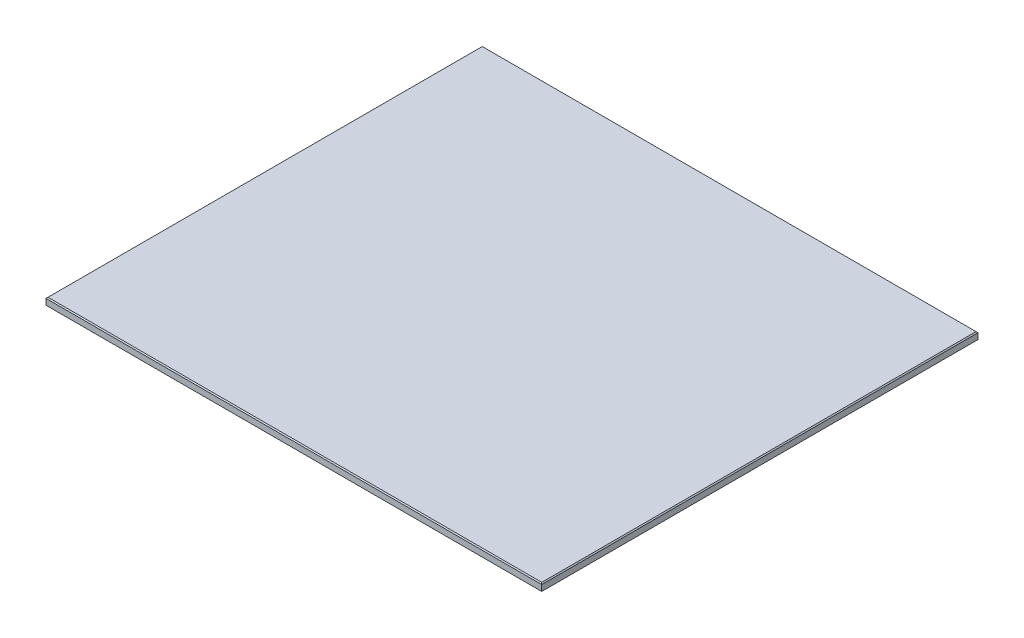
ISO-10303-21;
HEADER;
FILE_DESCRIPTION(('STEP AP214'),'2;1');
FILE_NAME('part.step','',(''),(''),'','','');
FILE_SCHEMA(('AUTOMOTIVE_DESIGN { 1 0 10303 214 1 1 1 1 }'));
ENDSEC;
DATA;
#1=APPLICATION_CONTEXT('core data for automotive mechanical design processes');
#2=APPLICATION_PROTOCOL_DEFINITION('international standard','automotive_design',2000,#1);
#3=PRODUCT_CONTEXT('',#1,'mechanical');
#4=PRODUCT('Part','Part','',(#3));
#5=PRODUCT_RELATED_PRODUCT_CATEGORY('part','',(#4));
#6=PRODUCT_DEFINITION_FORMATION('','',#4);
#7=PRODUCT_DEFINITION_CONTEXT('part definition',#1,'design');
#8=PRODUCT_DEFINITION('design','',#6,#7);
#9=PRODUCT_DEFINITION_SHAPE('','',#8);
#10=(LENGTH_UNIT() NAMED_UNIT(*) SI_UNIT(.MILLI.,.METRE.));
#11=(NAMED_UNIT(*) PLANE_ANGLE_UNIT() SI_UNIT($,.RADIAN.));
#12=(NAMED_UNIT(*) SI_UNIT($,.STERADIAN.) SOLID_ANGLE_UNIT());
#13=UNCERTAINTY_MEASURE_WITH_UNIT(LENGTH_MEASURE(1.E-05),#10,'distance_accuracy_value','');
#14=(GEOMETRIC_REPRESENTATION_CONTEXT(3) GLOBAL_UNCERTAINTY_ASSIGNED_CONTEXT((#13)) GLOBAL_UNIT_ASSIGNED_CONTEXT((#10,
#11,#12)) REPRESENTATION_CONTEXT('',''));
#15=CARTESIAN_POINT('',(0.,0.,0.));
#16=DIRECTION('',(0.,0.,1.));
#17=DIRECTION('',(1.,0.,0.));
#18=AXIS2_PLACEMENT_3D('',#15,#16,#17);
#19=CARTESIAN_POINT('',(125.,4.,110.));
#20=DIRECTION('',(-1.,0.,0.));
#21=DIRECTION('',(0.,0.,1.));
#22=AXIS2_PLACEMENT_3D('',#19,#20,#21);
#23=PLANE('',#22);
#24=DIRECTION('',(0.,-1.,0.));
#25=VECTOR('',#24,1.);
#26=CARTESIAN_POINT('',(125.,4.,110.));
#27=LINE('',#26,#25);
#28=CARTESIAN_POINT('',(125.,3.5,110.));
#29=VERTEX_POINT('',#28);
#30=CARTESIAN_POINT('',(125.,0.5,110.));
#31=VERTEX_POINT('',#30);
#32=EDGE_CURVE('E142',#29,#31,#27,.T.);
#33=ORIENTED_EDGE('',*,*,#32,.T.);
#34=DIRECTION('',(0.,0.,-1.));
#35=VECTOR('',#34,1.);
#36=CARTESIAN_POINT('',(125.,0.5,-110.));
#37=LINE('',#36,#35);
#38=CARTESIAN_POINT('',(125.,0.5,-110.));
#39=VERTEX_POINT('',#38);
#40=EDGE_CURVE('E151',#31,#39,#37,.T.);
#41=ORIENTED_EDGE('',*,*,#40,.T.);
#42=DIRECTION('',(0.,-1.,0.));
#43=VECTOR('',#42,1.);
#44=CARTESIAN_POINT('',(125.,4.,-110.));
#45=LINE('',#44,#43);
#46=CARTESIAN_POINT('',(125.,3.5,-110.));
#47=VERTEX_POINT('',#46);
#48=EDGE_CURVE('E120',#47,#39,#45,.T.);
#49=ORIENTED_EDGE('',*,*,#48,.F.);
#50=DIRECTION('',(0.,0.,1.));
#51=VECTOR('',#50,1.);
#52=CARTESIAN_POINT('',(125.,3.5,110.));
#53=LINE('',#52,#51);
#54=EDGE_CURVE('E153',#47,#29,#53,.T.);
#55=ORIENTED_EDGE('',*,*,#54,.T.);
#56=EDGE_LOOP('',(#33,#41,#49,#55));
#57=FACE_BOUND('',#56,.T.);
#58=ADVANCED_FACE('F33',(#57),#23,.F.);
#59=CARTESIAN_POINT('',(-125.,4.,-110.));
#60=DIRECTION('',(0.,0.,1.));
#61=DIRECTION('',(1.,0.,0.));
#62=AXIS2_PLACEMENT_3D('',#59,#60,#61);
#63=PLANE('',#62);
#64=ORIENTED_EDGE('',*,*,#48,.T.);
#65=DIRECTION('',(-1.,0.,0.));
#66=VECTOR('',#65,1.);
#67=CARTESIAN_POINT('',(-125.,0.5,-110.));
#68=LINE('',#67,#66);
#69=CARTESIAN_POINT('',(-125.,0.5,-110.));
#70=VERTEX_POINT('',#69);
#71=EDGE_CURVE('E119',#39,#70,#68,.T.);
#72=ORIENTED_EDGE('',*,*,#71,.T.);
#73=DIRECTION('',(0.,-1.,0.));
#74=VECTOR('',#73,1.);
#75=CARTESIAN_POINT('',(-125.,4.,-110.));
#76=LINE('',#75,#74);
#77=CARTESIAN_POINT('',(-125.,3.5,-110.));
#78=VERTEX_POINT('',#77);
#79=EDGE_CURVE('E102',#78,#70,#76,.T.);
#80=ORIENTED_EDGE('',*,*,#79,.F.);
#81=DIRECTION('',(1.,0.,0.));
#82=VECTOR('',#81,1.);
#83=CARTESIAN_POINT('',(-125.,3.5,-110.));
#84=LINE('',#83,#82);
#85=EDGE_CURVE('E116',#78,#47,#84,.T.);
#86=ORIENTED_EDGE('',*,*,#85,.T.);
#87=EDGE_LOOP('',(#64,#72,#80,#86));
#88=FACE_BOUND('',#87,.T.);
#89=ADVANCED_FACE('F115',(#88),#63,.F.);
#90=CARTESIAN_POINT('',(-125.,4.,110.));
#91=DIRECTION('',(1.,0.,0.));
#92=DIRECTION('',(0.,0.,-1.));
#93=AXIS2_PLACEMENT_3D('',#90,#91,#92);
#94=PLANE('',#93);
#95=ORIENTED_EDGE('',*,*,#79,.T.);
#96=DIRECTION('',(0.,0.,1.));
#97=VECTOR('',#96,1.);
#98=CARTESIAN_POINT('',(-125.,0.5,110.));
#99=LINE('',#98,#97);
#100=CARTESIAN_POINT('',(-125.,0.5,110.));
#101=VERTEX_POINT('',#100);
#102=EDGE_CURVE('E108',#70,#101,#99,.T.);
#103=ORIENTED_EDGE('',*,*,#102,.T.);
#104=DIRECTION('',(0.,-1.,0.));
#105=VECTOR('',#104,1.);
#106=CARTESIAN_POINT('',(-125.,4.,110.));
#107=LINE('',#106,#105);
#108=CARTESIAN_POINT('',(-125.,3.5,110.));
#109=VERTEX_POINT('',#108);
#110=EDGE_CURVE('E104',#109,#101,#107,.T.);
#111=ORIENTED_EDGE('',*,*,#110,.F.);
#112=DIRECTION('',(0.,0.,-1.));
#113=VECTOR('',#112,1.);
#114=CARTESIAN_POINT('',(-125.,3.5,110.));
#115=LINE('',#114,#113);
#116=EDGE_CURVE('E99',#109,#78,#115,.T.);
#117=ORIENTED_EDGE('',*,*,#116,.T.);
#118=EDGE_LOOP('',(#95,#103,#111,#117));
#119=FACE_BOUND('',#118,.T.);
#120=ADVANCED_FACE('F101',(#119),#94,.F.);
#121=CARTESIAN_POINT('',(-125.,4.,110.));
#122=DIRECTION('',(0.,0.,-1.));
#123=DIRECTION('',(-1.,0.,0.));
#124=AXIS2_PLACEMENT_3D('',#121,#122,#123);
#125=PLANE('',#124);
#126=ORIENTED_EDGE('',*,*,#110,.T.);
#127=DIRECTION('',(1.,0.,0.));
#128=VECTOR('',#127,1.);
#129=CARTESIAN_POINT('',(125.,0.5,110.));
#130=LINE('',#129,#128);
#131=EDGE_CURVE('E155',#101,#31,#130,.T.);
#132=ORIENTED_EDGE('',*,*,#131,.T.);
#133=ORIENTED_EDGE('',*,*,#32,.F.);
#134=DIRECTION('',(-1.,0.,0.));
#135=VECTOR('',#134,1.);
#136=CARTESIAN_POINT('',(-125.,3.5,110.));
#137=LINE('',#136,#135);
#138=EDGE_CURVE('E157',#29,#109,#137,.T.);
#139=ORIENTED_EDGE('',*,*,#138,.T.);
#140=EDGE_LOOP('',(#126,#132,#133,#139));
#141=FACE_BOUND('',#140,.T.);
#142=ADVANCED_FACE('F195',(#141),#125,.F.);
#143=CARTESIAN_POINT('',(0.,4.,0.));
#144=DIRECTION('',(0.,-1.,0.));
#145=DIRECTION('',(0.,0.,-1.));
#146=AXIS2_PLACEMENT_3D('',#143,#144,#145);
#147=PLANE('',#146);
#148=DIRECTION('',(0.,0.,1.));
#149=VECTOR('',#148,1.);
#150=CARTESIAN_POINT('',(-124.5,4.,0.));
#151=LINE('',#150,#149);
#152=CARTESIAN_POINT('',(-124.5,4.,-109.5));
#153=VERTEX_POINT('',#152);
#154=CARTESIAN_POINT('',(-124.5,4.,109.5));
#155=VERTEX_POINT('',#154);
#156=EDGE_CURVE('E42',#153,#155,#151,.T.);
#157=ORIENTED_EDGE('',*,*,#156,.T.);
#158=DIRECTION('',(1.,0.,0.));
#159=VECTOR('',#158,1.);
#160=CARTESIAN_POINT('',(0.,4.,109.5));
#161=LINE('',#160,#159);
#162=CARTESIAN_POINT('',(124.5,4.,109.5));
#163=VERTEX_POINT('',#162);
#164=EDGE_CURVE('E11',#155,#163,#161,.T.);
#165=ORIENTED_EDGE('',*,*,#164,.T.);
#166=DIRECTION('',(0.,0.,-1.));
#167=VECTOR('',#166,1.);
#168=CARTESIAN_POINT('',(124.5,4.,0.));
#169=LINE('',#168,#167);
#170=CARTESIAN_POINT('',(124.5,4.,-109.5));
#171=VERTEX_POINT('',#170);
#172=EDGE_CURVE('E149',#163,#171,#169,.T.);
#173=ORIENTED_EDGE('',*,*,#172,.T.);
#174=DIRECTION('',(-1.,0.,0.));
#175=VECTOR('',#174,1.);
#176=CARTESIAN_POINT('',(0.,4.,-109.5));
#177=LINE('',#176,#175);
#178=EDGE_CURVE('E53',#171,#153,#177,.T.);
#179=ORIENTED_EDGE('',*,*,#178,.T.);
#180=EDGE_LOOP('',(#157,#165,#173,#179));
#181=FACE_BOUND('',#180,.T.);
#182=ADVANCED_FACE('F201',(#181),#147,.F.);
#183=CARTESIAN_POINT('',(0.,0.,0.));
#184=DIRECTION('',(0.,-1.,0.));
#185=DIRECTION('',(0.,0.,-1.));
#186=AXIS2_PLACEMENT_3D('',#183,#184,#185);
#187=PLANE('',#186);
#188=DIRECTION('',(0.,0.,-1.));
#189=VECTOR('',#188,1.);
#190=CARTESIAN_POINT('',(-124.5,0.,-110.));
#191=LINE('',#190,#189);
#192=CARTESIAN_POINT('',(-124.5,0.,109.5));
#193=VERTEX_POINT('',#192);
#194=CARTESIAN_POINT('',(-124.5,0.,-109.5));
#195=VERTEX_POINT('',#194);
#196=EDGE_CURVE('E162',#193,#195,#191,.T.);
#197=ORIENTED_EDGE('',*,*,#196,.T.);
#198=DIRECTION('',(1.,0.,0.));
#199=VECTOR('',#198,1.);
#200=CARTESIAN_POINT('',(125.,0.,-109.5));
#201=LINE('',#200,#199);
#202=CARTESIAN_POINT('',(124.5,0.,-109.5));
#203=VERTEX_POINT('',#202);
#204=EDGE_CURVE('E109',#195,#203,#201,.T.);
#205=ORIENTED_EDGE('',*,*,#204,.T.);
#206=DIRECTION('',(0.,0.,1.));
#207=VECTOR('',#206,1.);
#208=CARTESIAN_POINT('',(124.5,0.,110.));
#209=LINE('',#208,#207);
#210=CARTESIAN_POINT('',(124.5,0.,109.5));
#211=VERTEX_POINT('',#210);
#212=EDGE_CURVE('E166',#203,#211,#209,.T.);
#213=ORIENTED_EDGE('',*,*,#212,.T.);
#214=DIRECTION('',(-1.,0.,0.));
#215=VECTOR('',#214,1.);
#216=CARTESIAN_POINT('',(-125.,0.,109.5));
#217=LINE('',#216,#215);
#218=EDGE_CURVE('E164',#211,#193,#217,.T.);
#219=ORIENTED_EDGE('',*,*,#218,.T.);
#220=EDGE_LOOP('',(#197,#205,#213,#219));
#221=FACE_BOUND('',#220,.T.);
#222=ADVANCED_FACE('F203',(#221),#187,.T.);
#223=CARTESIAN_POINT('',(-125.,0.5,110.));
#224=DIRECTION('',(0.,-0.707106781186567,0.707106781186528));
#225=DIRECTION('',(-1.,0.,0.));
#226=AXIS2_PLACEMENT_3D('',#223,#224,#225);
#227=PLANE('',#226);
#228=DIRECTION('',(0.577350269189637,-0.577350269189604,-0.577350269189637));
#229=VECTOR('',#228,1.);
#230=CARTESIAN_POINT('',(-125.,0.5,110.));
#231=LINE('',#230,#229);
#232=EDGE_CURVE('E143',#193,#101,#231,.F.);
#233=ORIENTED_EDGE('',*,*,#232,.F.);
#234=ORIENTED_EDGE('',*,*,#218,.F.);
#235=DIRECTION('',(-0.577350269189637,-0.577350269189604,-0.577350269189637));
#236=VECTOR('',#235,1.);
#237=CARTESIAN_POINT('',(125.,0.5,110.));
#238=LINE('',#237,#236);
#239=EDGE_CURVE('E139',#31,#211,#238,.T.);
#240=ORIENTED_EDGE('',*,*,#239,.F.);
#241=ORIENTED_EDGE('',*,*,#131,.F.);
#242=EDGE_LOOP('',(#233,#234,#240,#241));
#243=FACE_BOUND('',#242,.T.);
#244=ADVANCED_FACE('F182',(#243),#227,.T.);
#245=CARTESIAN_POINT('',(125.,0.5,110.));
#246=DIRECTION('',(0.707106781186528,-0.707106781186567,0.));
#247=DIRECTION('',(0.,0.,1.));
#248=AXIS2_PLACEMENT_3D('',#245,#246,#247);
#249=PLANE('',#248);
#250=ORIENTED_EDGE('',*,*,#239,.T.);
#251=ORIENTED_EDGE('',*,*,#212,.F.);
#252=DIRECTION('',(0.577350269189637,0.577350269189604,-0.577350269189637));
#253=VECTOR('',#252,1.);
#254=CARTESIAN_POINT('',(51.6666666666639,-72.833333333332,-36.666666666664));
#255=LINE('',#254,#253);
#256=EDGE_CURVE('E130',#39,#203,#255,.F.);
#257=ORIENTED_EDGE('',*,*,#256,.F.);
#258=ORIENTED_EDGE('',*,*,#40,.F.);
#259=EDGE_LOOP('',(#250,#251,#257,#258));
#260=FACE_BOUND('',#259,.T.);
#261=ADVANCED_FACE('F186',(#260),#249,.T.);
#262=CARTESIAN_POINT('',(-125.,0.5,110.));
#263=DIRECTION('',(-0.707106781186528,-0.707106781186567,0.));
#264=DIRECTION('',(0.,0.,-1.));
#265=AXIS2_PLACEMENT_3D('',#262,#263,#264);
#266=PLANE('',#265);
#267=ORIENTED_EDGE('',*,*,#232,.T.);
#268=ORIENTED_EDGE('',*,*,#102,.F.);
#269=DIRECTION('',(0.577350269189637,-0.577350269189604,0.577350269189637));
#270=VECTOR('',#269,1.);
#271=CARTESIAN_POINT('',(-51.6666666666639,-72.833333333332,-36.666666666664));
#272=LINE('',#271,#270);
#273=EDGE_CURVE('E129',#195,#70,#272,.F.);
#274=ORIENTED_EDGE('',*,*,#273,.F.);
#275=ORIENTED_EDGE('',*,*,#196,.F.);
#276=EDGE_LOOP('',(#267,#268,#274,#275));
#277=FACE_BOUND('',#276,.T.);
#278=ADVANCED_FACE('F194',(#277),#266,.T.);
#279=CARTESIAN_POINT('',(-125.,0.5,-110.));
#280=DIRECTION('',(0.,-0.707106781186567,-0.707106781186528));
#281=DIRECTION('',(1.,0.,0.));
#282=AXIS2_PLACEMENT_3D('',#279,#280,#281);
#283=PLANE('',#282);
#284=ORIENTED_EDGE('',*,*,#256,.T.);
#285=ORIENTED_EDGE('',*,*,#204,.F.);
#286=ORIENTED_EDGE('',*,*,#273,.T.);
#287=ORIENTED_EDGE('',*,*,#71,.F.);
#288=EDGE_LOOP('',(#284,#285,#286,#287));
#289=FACE_BOUND('',#288,.T.);
#290=ADVANCED_FACE('F189',(#289),#283,.T.);
#291=CARTESIAN_POINT('',(0.,4.,-109.5));
#292=DIRECTION('',(0.,-0.707106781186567,0.707106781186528));
#293=DIRECTION('',(-1.,0.,0.));
#294=AXIS2_PLACEMENT_3D('',#291,#292,#293);
#295=PLANE('',#294);
#296=DIRECTION('',(-0.577350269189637,0.577350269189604,0.577350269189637));
#297=VECTOR('',#296,1.);
#298=CARTESIAN_POINT('',(87.9999999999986,40.4999999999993,-72.9999999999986));
#299=LINE('',#298,#297);
#300=EDGE_CURVE('E125',#47,#171,#299,.T.);
#301=ORIENTED_EDGE('',*,*,#300,.F.);
#302=ORIENTED_EDGE('',*,*,#85,.F.);
#303=DIRECTION('',(0.577350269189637,0.577350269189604,0.577350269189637));
#304=VECTOR('',#303,1.);
#305=CARTESIAN_POINT('',(-82.9999999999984,45.4999999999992,-67.9999999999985));
#306=LINE('',#305,#304);
#307=EDGE_CURVE('E37',#153,#78,#306,.F.);
#308=ORIENTED_EDGE('',*,*,#307,.F.);
#309=ORIENTED_EDGE('',*,*,#178,.F.);
#310=EDGE_LOOP('',(#301,#302,#308,#309));
#311=FACE_BOUND('',#310,.T.);
#312=ADVANCED_FACE('F35',(#311),#295,.F.);
#313=CARTESIAN_POINT('',(-124.5,4.,0.));
#314=DIRECTION('',(0.707106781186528,-0.707106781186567,0.));
#315=DIRECTION('',(0.,0.,1.));
#316=AXIS2_PLACEMENT_3D('',#313,#314,#315);
#317=PLANE('',#316);
#318=ORIENTED_EDGE('',*,*,#307,.T.);
#319=ORIENTED_EDGE('',*,*,#116,.F.);
#320=DIRECTION('',(0.577350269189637,0.577350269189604,-0.577350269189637));
#321=VECTOR('',#320,1.);
#322=CARTESIAN_POINT('',(-87.9999999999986,40.4999999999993,72.9999999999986));
#323=LINE('',#322,#321);
#324=EDGE_CURVE('E132',#155,#109,#323,.F.);
#325=ORIENTED_EDGE('',*,*,#324,.F.);
#326=ORIENTED_EDGE('',*,*,#156,.F.);
#327=EDGE_LOOP('',(#318,#319,#325,#326));
#328=FACE_BOUND('',#327,.T.);
#329=ADVANCED_FACE('F128',(#328),#317,.F.);
#330=CARTESIAN_POINT('',(124.5,4.,0.));
#331=DIRECTION('',(-0.707106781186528,-0.707106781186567,0.));
#332=DIRECTION('',(0.,0.,-1.));
#333=AXIS2_PLACEMENT_3D('',#330,#331,#332);
#334=PLANE('',#333);
#335=ORIENTED_EDGE('',*,*,#300,.T.);
#336=ORIENTED_EDGE('',*,*,#172,.F.);
#337=DIRECTION('',(0.577350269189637,-0.577350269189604,0.577350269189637));
#338=VECTOR('',#337,1.);
#339=CARTESIAN_POINT('',(87.9999999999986,40.4999999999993,72.9999999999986));
#340=LINE('',#339,#338);
#341=EDGE_CURVE('E135',#29,#163,#340,.F.);
#342=ORIENTED_EDGE('',*,*,#341,.F.);
#343=ORIENTED_EDGE('',*,*,#54,.F.);
#344=EDGE_LOOP('',(#335,#336,#342,#343));
#345=FACE_BOUND('',#344,.T.);
#346=ADVANCED_FACE('F200',(#345),#334,.F.);
#347=CARTESIAN_POINT('',(0.,4.,109.5));
#348=DIRECTION('',(0.,-0.707106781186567,-0.707106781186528));
#349=DIRECTION('',(1.,0.,0.));
#350=AXIS2_PLACEMENT_3D('',#347,#348,#349);
#351=PLANE('',#350);
#352=ORIENTED_EDGE('',*,*,#324,.T.);
#353=ORIENTED_EDGE('',*,*,#138,.F.);
#354=ORIENTED_EDGE('',*,*,#341,.T.);
#355=ORIENTED_EDGE('',*,*,#164,.F.);
#356=EDGE_LOOP('',(#352,#353,#354,#355));
#357=FACE_BOUND('',#356,.T.);
#358=ADVANCED_FACE('F198',(#357),#351,.F.);
#359=CLOSED_SHELL('',(#58,#89,#120,#142,#182,#222,#244,#261,#278,#290,#312,#329,#346,#358));
#360=MANIFOLD_SOLID_BREP('B2',#359);
#361=ADVANCED_BREP_SHAPE_REPRESENTATION('',(#18,#360),#14);
#362=SHAPE_DEFINITION_REPRESENTATION(#9,#361);
ENDSEC;
END-ISO-10303-21;
